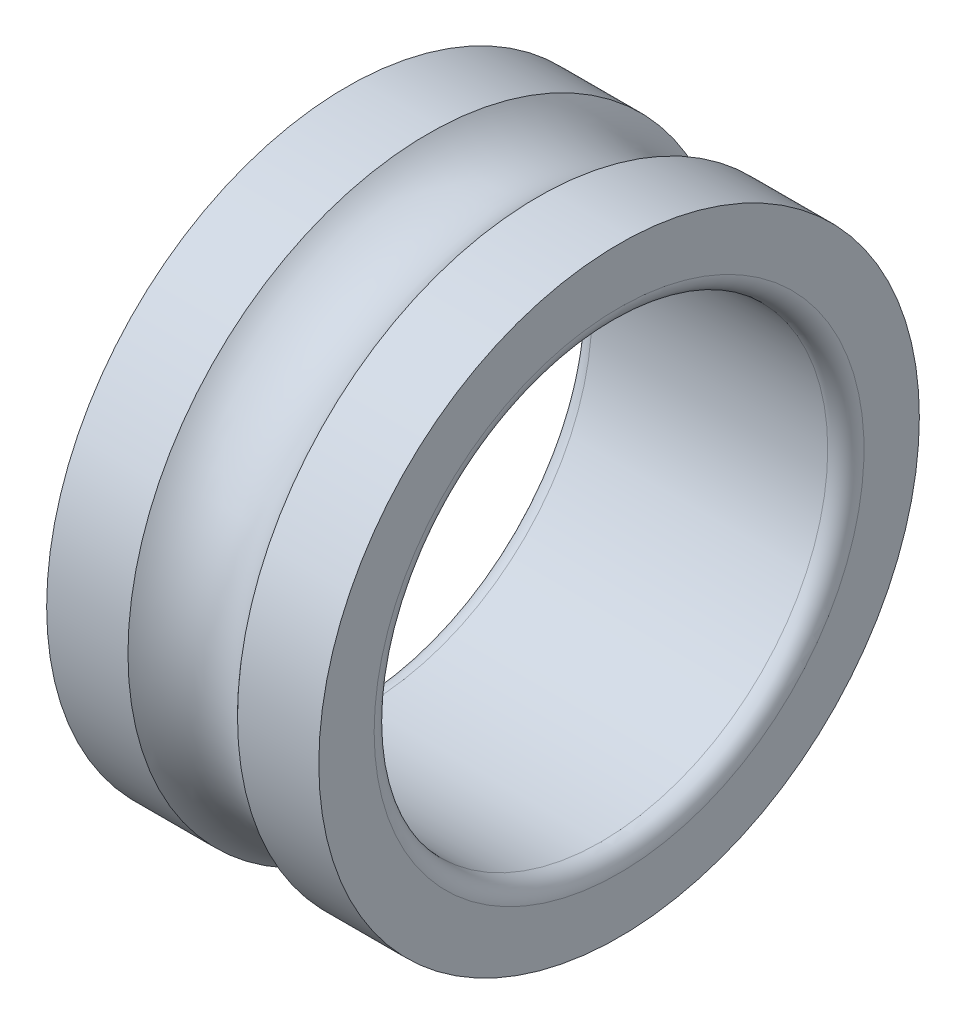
from build123d import *


with BuildPart() as part:
    # Esquisse1 → Base-R_volution (revolve)
    with BuildSketch(Plane(origin=(0, 0, 0), x_dir=(1, 0, 0), z_dir=(0, 1, 0)), mode=Mode.PRIVATE) as base_r_volution_sk:
        with BuildLine():
            Line((0, 16.55), (0, 13.5))
            ThreePointArc((0, 13.5), (0.292893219, 12.792893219), (1, 12.5))
            Line((1, 12.5), (14, 12.5))
            ThreePointArc((14, 12.5), (14.707106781, 12.792893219), (15, 13.5))
            Line((15, 13.5), (15, 16.55))
            Line((15, 16.55), (10.51869177, 16.55))
            ThreePointArc((10.51869177, 16.55), (7.5, 15.2), (4.48130823, 16.55))
            Line((4.48130823, 16.55), (0, 16.55))
        make_face()
    revolve(base_r_volution_sk.sketch.rotate(Axis((0, 0, 0), (1, 0, 0)), 180), axis=Axis((0, 0, 0), (1, 0, 0)))


solid = part.part
